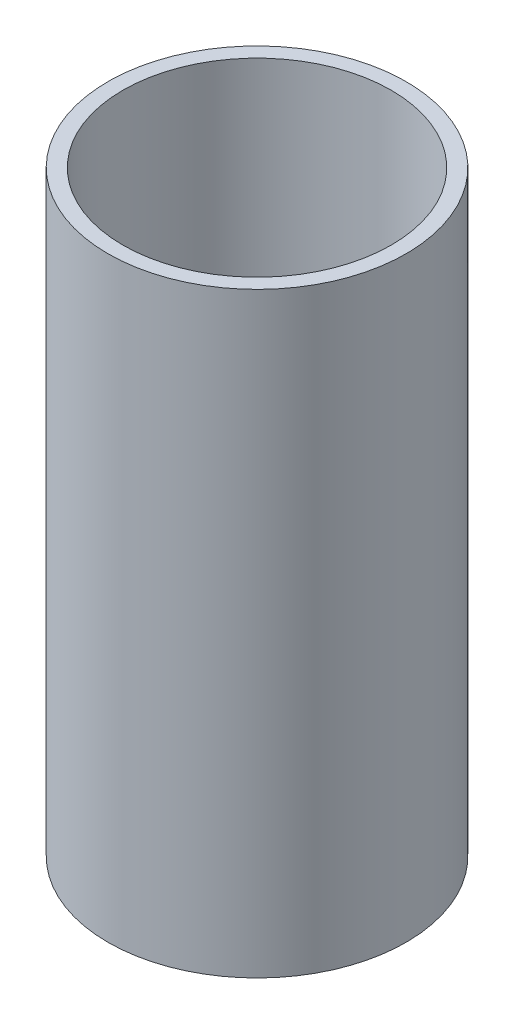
from build123d import *

# Parameters (mm, degrees)
ESQUISSE1_R      = 15
ESQUISSE1_R_2    = 13.5
EXTRUSION1_DEPTH = 60


with BuildPart() as part:
    # Esquisse1 → Extrusion1 (new body)
    with BuildSketch(Plane(origin=(0, 0, 0), x_dir=(1, 0, 0), z_dir=(0, 1, 0))):
        with Locations(Location((0, 0, 0), (0, 0, 270))):
            Circle(ESQUISSE1_R)
        with Locations(Location((0, 0, 0), (0, 0, 270))):
            Circle(ESQUISSE1_R_2, mode=Mode.SUBTRACT)
    extrude(amount=EXTRUSION1_DEPTH)


solid = part.part
